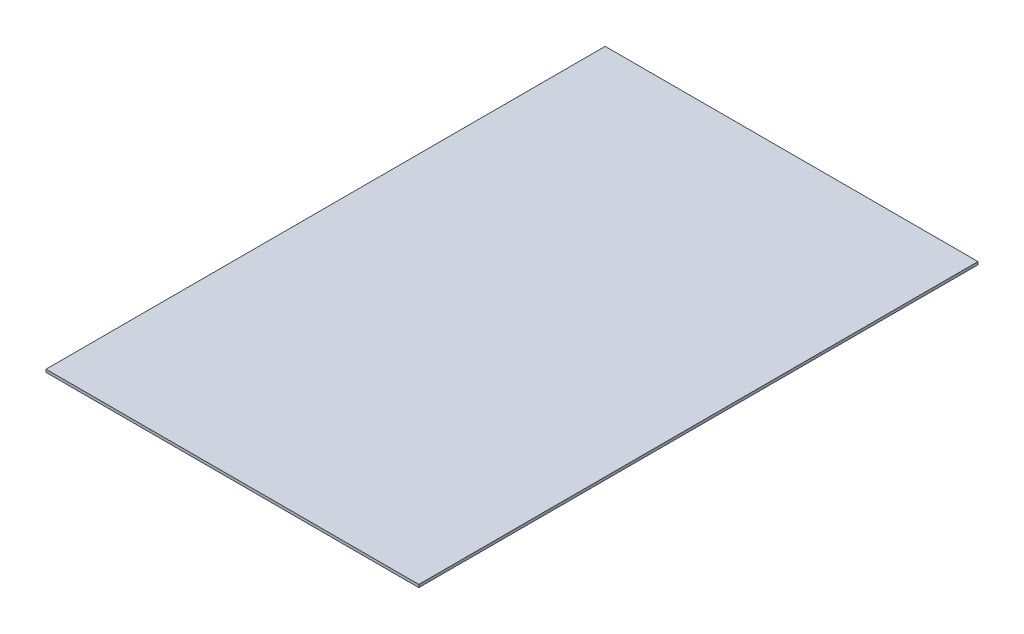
ISO-10303-21;
HEADER;
FILE_DESCRIPTION(('STEP AP214'),'2;1');
FILE_NAME('part.step','',(''),(''),'','','');
FILE_SCHEMA(('AUTOMOTIVE_DESIGN { 1 0 10303 214 1 1 1 1 }'));
ENDSEC;
DATA;
#1=APPLICATION_CONTEXT('core data for automotive mechanical design processes');
#2=APPLICATION_PROTOCOL_DEFINITION('international standard','automotive_design',2000,#1);
#3=PRODUCT_CONTEXT('',#1,'mechanical');
#4=PRODUCT('Part','Part','',(#3));
#5=PRODUCT_RELATED_PRODUCT_CATEGORY('part','',(#4));
#6=PRODUCT_DEFINITION_FORMATION('','',#4);
#7=PRODUCT_DEFINITION_CONTEXT('part definition',#1,'design');
#8=PRODUCT_DEFINITION('design','',#6,#7);
#9=PRODUCT_DEFINITION_SHAPE('','',#8);
#10=(LENGTH_UNIT() NAMED_UNIT(*) SI_UNIT(.MILLI.,.METRE.));
#11=(NAMED_UNIT(*) PLANE_ANGLE_UNIT() SI_UNIT($,.RADIAN.));
#12=(NAMED_UNIT(*) SI_UNIT($,.STERADIAN.) SOLID_ANGLE_UNIT());
#13=UNCERTAINTY_MEASURE_WITH_UNIT(LENGTH_MEASURE(1.E-05),#10,'distance_accuracy_value','');
#14=(GEOMETRIC_REPRESENTATION_CONTEXT(3) GLOBAL_UNCERTAINTY_ASSIGNED_CONTEXT((#13)) GLOBAL_UNIT_ASSIGNED_CONTEXT((#10,
#11,#12)) REPRESENTATION_CONTEXT('',''));
#15=CARTESIAN_POINT('',(0.,0.,0.));
#16=DIRECTION('',(0.,0.,1.));
#17=DIRECTION('',(1.,0.,0.));
#18=AXIS2_PLACEMENT_3D('',#15,#16,#17);
#19=CARTESIAN_POINT('',(0.,3.,0.));
#20=DIRECTION('',(1.,0.,0.));
#21=DIRECTION('',(0.,0.,-1.));
#22=AXIS2_PLACEMENT_3D('',#19,#20,#21);
#23=PLANE('',#22);
#24=DIRECTION('',(0.,0.,1.));
#25=VECTOR('',#24,1.);
#26=CARTESIAN_POINT('',(0.,0.,0.));
#27=LINE('',#26,#25);
#28=CARTESIAN_POINT('',(0.,0.,-600.));
#29=VERTEX_POINT('',#28);
#30=CARTESIAN_POINT('',(0.,0.,0.));
#31=VERTEX_POINT('',#30);
#32=EDGE_CURVE('E70',#29,#31,#27,.T.);
#33=ORIENTED_EDGE('',*,*,#32,.T.);
#34=DIRECTION('',(0.,-1.,0.));
#35=VECTOR('',#34,1.);
#36=CARTESIAN_POINT('',(0.,3.,0.));
#37=LINE('',#36,#35);
#38=CARTESIAN_POINT('',(0.,3.,0.));
#39=VERTEX_POINT('',#38);
#40=EDGE_CURVE('E11',#39,#31,#37,.T.);
#41=ORIENTED_EDGE('',*,*,#40,.F.);
#42=DIRECTION('',(0.,0.,1.));
#43=VECTOR('',#42,1.);
#44=CARTESIAN_POINT('',(0.,3.,0.));
#45=LINE('',#44,#43);
#46=CARTESIAN_POINT('',(0.,3.,-600.));
#47=VERTEX_POINT('',#46);
#48=EDGE_CURVE('E88',#47,#39,#45,.T.);
#49=ORIENTED_EDGE('',*,*,#48,.F.);
#50=DIRECTION('',(0.,-1.,0.));
#51=VECTOR('',#50,1.);
#52=CARTESIAN_POINT('',(0.,3.,-600.));
#53=LINE('',#52,#51);
#54=EDGE_CURVE('E82',#47,#29,#53,.T.);
#55=ORIENTED_EDGE('',*,*,#54,.T.);
#56=EDGE_LOOP('',(#33,#41,#49,#55));
#57=FACE_BOUND('',#56,.T.);
#58=ADVANCED_FACE('F26',(#57),#23,.F.);
#59=CARTESIAN_POINT('',(0.,3.,0.));
#60=DIRECTION('',(0.,0.,-1.));
#61=DIRECTION('',(-1.,0.,0.));
#62=AXIS2_PLACEMENT_3D('',#59,#60,#61);
#63=PLANE('',#62);
#64=DIRECTION('',(1.,0.,0.));
#65=VECTOR('',#64,1.);
#66=CARTESIAN_POINT('',(0.,0.,0.));
#67=LINE('',#66,#65);
#68=CARTESIAN_POINT('',(400.,0.,0.));
#69=VERTEX_POINT('',#68);
#70=EDGE_CURVE('E66',#31,#69,#67,.T.);
#71=ORIENTED_EDGE('',*,*,#70,.T.);
#72=DIRECTION('',(0.,-1.,0.));
#73=VECTOR('',#72,1.);
#74=CARTESIAN_POINT('',(400.,3.,0.));
#75=LINE('',#74,#73);
#76=CARTESIAN_POINT('',(400.,3.,0.));
#77=VERTEX_POINT('',#76);
#78=EDGE_CURVE('E33',#77,#69,#75,.T.);
#79=ORIENTED_EDGE('',*,*,#78,.F.);
#80=DIRECTION('',(1.,0.,0.));
#81=VECTOR('',#80,1.);
#82=CARTESIAN_POINT('',(0.,3.,0.));
#83=LINE('',#82,#81);
#84=EDGE_CURVE('E78',#39,#77,#83,.T.);
#85=ORIENTED_EDGE('',*,*,#84,.F.);
#86=ORIENTED_EDGE('',*,*,#40,.T.);
#87=EDGE_LOOP('',(#71,#79,#85,#86));
#88=FACE_BOUND('',#87,.T.);
#89=ADVANCED_FACE('F77',(#88),#63,.F.);
#90=CARTESIAN_POINT('',(400.,3.,0.));
#91=DIRECTION('',(-1.,0.,0.));
#92=DIRECTION('',(0.,0.,1.));
#93=AXIS2_PLACEMENT_3D('',#90,#91,#92);
#94=PLANE('',#93);
#95=DIRECTION('',(0.,0.,-1.));
#96=VECTOR('',#95,1.);
#97=CARTESIAN_POINT('',(400.,0.,0.));
#98=LINE('',#97,#96);
#99=CARTESIAN_POINT('',(400.,0.,-600.));
#100=VERTEX_POINT('',#99);
#101=EDGE_CURVE('E71',#69,#100,#98,.T.);
#102=ORIENTED_EDGE('',*,*,#101,.T.);
#103=DIRECTION('',(0.,-1.,0.));
#104=VECTOR('',#103,1.);
#105=CARTESIAN_POINT('',(400.,3.,-600.));
#106=LINE('',#105,#104);
#107=CARTESIAN_POINT('',(400.,3.,-600.));
#108=VERTEX_POINT('',#107);
#109=EDGE_CURVE('E94',#108,#100,#106,.T.);
#110=ORIENTED_EDGE('',*,*,#109,.F.);
#111=DIRECTION('',(0.,0.,-1.));
#112=VECTOR('',#111,1.);
#113=CARTESIAN_POINT('',(400.,3.,0.));
#114=LINE('',#113,#112);
#115=EDGE_CURVE('E45',#77,#108,#114,.T.);
#116=ORIENTED_EDGE('',*,*,#115,.F.);
#117=ORIENTED_EDGE('',*,*,#78,.T.);
#118=EDGE_LOOP('',(#102,#110,#116,#117));
#119=FACE_BOUND('',#118,.T.);
#120=ADVANCED_FACE('F97',(#119),#94,.F.);
#121=CARTESIAN_POINT('',(0.,3.,-600.));
#122=DIRECTION('',(0.,0.,1.));
#123=DIRECTION('',(1.,0.,0.));
#124=AXIS2_PLACEMENT_3D('',#121,#122,#123);
#125=PLANE('',#124);
#126=DIRECTION('',(-1.,0.,0.));
#127=VECTOR('',#126,1.);
#128=CARTESIAN_POINT('',(0.,0.,-600.));
#129=LINE('',#128,#127);
#130=EDGE_CURVE('E86',#100,#29,#129,.T.);
#131=ORIENTED_EDGE('',*,*,#130,.T.);
#132=ORIENTED_EDGE('',*,*,#54,.F.);
#133=DIRECTION('',(-1.,0.,0.));
#134=VECTOR('',#133,1.);
#135=CARTESIAN_POINT('',(0.,3.,-600.));
#136=LINE('',#135,#134);
#137=EDGE_CURVE('E40',#108,#47,#136,.T.);
#138=ORIENTED_EDGE('',*,*,#137,.F.);
#139=ORIENTED_EDGE('',*,*,#109,.T.);
#140=EDGE_LOOP('',(#131,#132,#138,#139));
#141=FACE_BOUND('',#140,.T.);
#142=ADVANCED_FACE('F99',(#141),#125,.F.);
#143=CARTESIAN_POINT('',(0.,3.,-600.));
#144=DIRECTION('',(0.,-1.,0.));
#145=DIRECTION('',(0.,0.,-1.));
#146=AXIS2_PLACEMENT_3D('',#143,#144,#145);
#147=PLANE('',#146);
#148=ORIENTED_EDGE('',*,*,#48,.T.);
#149=ORIENTED_EDGE('',*,*,#84,.T.);
#150=ORIENTED_EDGE('',*,*,#115,.T.);
#151=ORIENTED_EDGE('',*,*,#137,.T.);
#152=EDGE_LOOP('',(#148,#149,#150,#151));
#153=FACE_BOUND('',#152,.T.);
#154=ADVANCED_FACE('F100',(#153),#147,.F.);
#155=CARTESIAN_POINT('',(0.,0.,-600.));
#156=DIRECTION('',(0.,-1.,0.));
#157=DIRECTION('',(0.,0.,-1.));
#158=AXIS2_PLACEMENT_3D('',#155,#156,#157);
#159=PLANE('',#158);
#160=ORIENTED_EDGE('',*,*,#32,.F.);
#161=ORIENTED_EDGE('',*,*,#130,.F.);
#162=ORIENTED_EDGE('',*,*,#101,.F.);
#163=ORIENTED_EDGE('',*,*,#70,.F.);
#164=EDGE_LOOP('',(#160,#161,#162,#163));
#165=FACE_BOUND('',#164,.T.);
#166=ADVANCED_FACE('F67',(#165),#159,.T.);
#167=CLOSED_SHELL('',(#58,#89,#120,#142,#154,#166));
#168=MANIFOLD_SOLID_BREP('B2',#167);
#169=ADVANCED_BREP_SHAPE_REPRESENTATION('',(#18,#168),#14);
#170=SHAPE_DEFINITION_REPRESENTATION(#9,#169);
ENDSEC;
END-ISO-10303-21;
